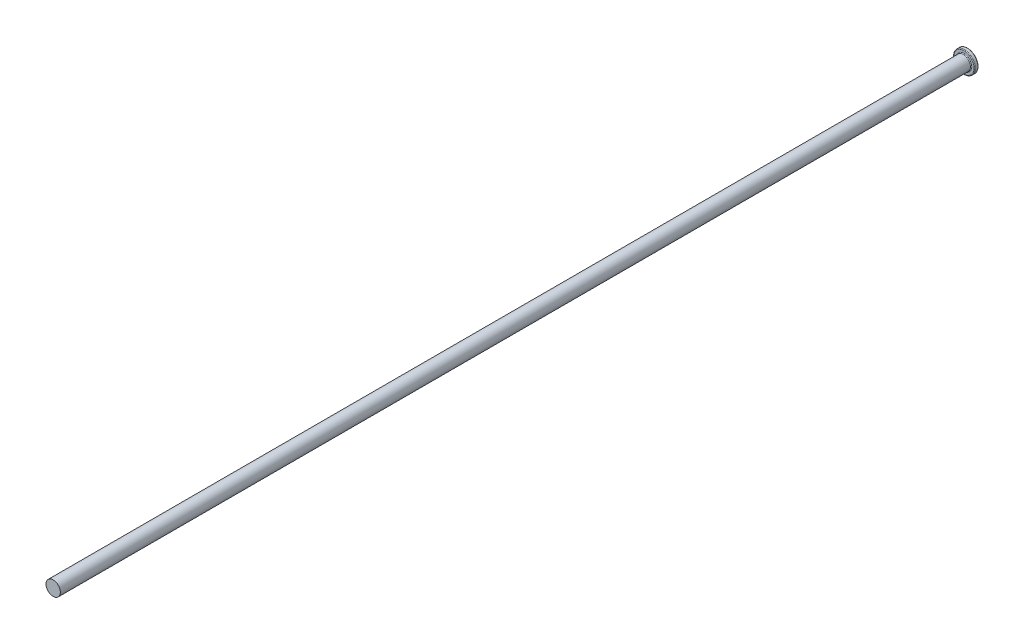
from build123d import *

# Parameters (mm, degrees)
SKETCH1_R           = 1
BOSS_EXTRUDE2_DEPTH = 127
SKETCH2_R           = 1.5
BOSS_EXTRUDE3_DEPTH = 0.5
FILLET1_R           = 0.1
FILLET4_R           = 0.1
FILLET5_R           = 0.05


with BuildPart() as part:
    # Sketch1 → Boss-Extrude2 (new body)
    with BuildSketch(Plane.XY):
        Circle(SKETCH1_R)
    extrude(amount=BOSS_EXTRUDE2_DEPTH)

    # Sketch2 → Boss-Extrude3 (add)
    with BuildSketch(Plane(origin=(0, 0, 0), x_dir=(-1, 0, 0), z_dir=(0, 0, -1))):
        Circle(SKETCH2_R)
    extrude(amount=BOSS_EXTRUDE3_DEPTH)

    # Fillet1
    fillet1_edges = [part.edges().sort_by_distance(p)[0] for p in [
        (-1, 0, 0),
    ]]
    fillet(fillet1_edges, radius=FILLET1_R)

    # Fillet4
    fillet4_edges = [part.edges().sort_by_distance(p)[0] for p in [
        (1.5, 0, 0),
    ]]
    fillet(fillet4_edges, radius=FILLET4_R)

    # Fillet5
    fillet5_edges = [part.edges().sort_by_distance(p)[0] for p in [
        (1.5, 0, -0.5),
    ]]
    fillet(fillet5_edges, radius=FILLET5_R)


solid = part.part
